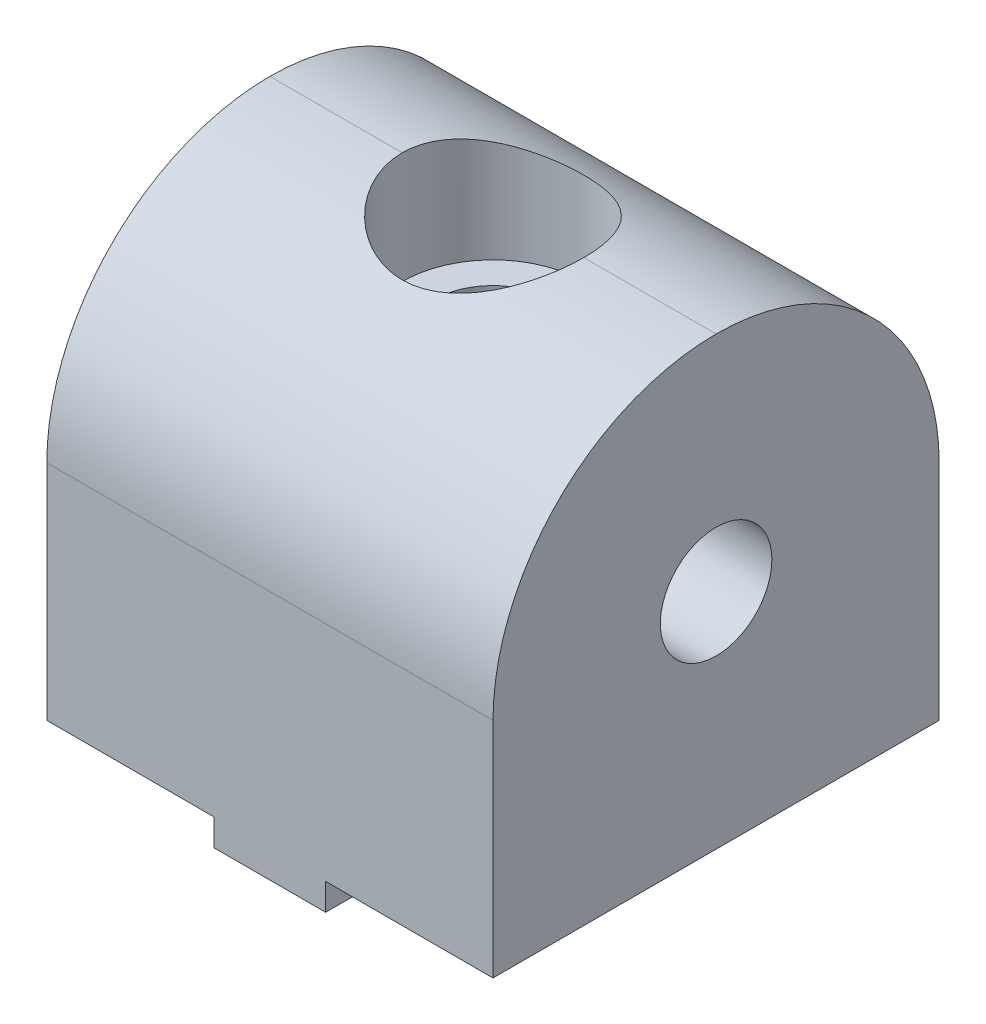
ISO-10303-21;
HEADER;
FILE_DESCRIPTION(('STEP AP214'),'2;1');
FILE_NAME('part.step','',(''),(''),'','','');
FILE_SCHEMA(('AUTOMOTIVE_DESIGN { 1 0 10303 214 1 1 1 1 }'));
ENDSEC;
DATA;
#1=APPLICATION_CONTEXT('core data for automotive mechanical design processes');
#2=APPLICATION_PROTOCOL_DEFINITION('international standard','automotive_design',2000,#1);
#3=PRODUCT_CONTEXT('',#1,'mechanical');
#4=PRODUCT('Part','Part','',(#3));
#5=PRODUCT_RELATED_PRODUCT_CATEGORY('part','',(#4));
#6=PRODUCT_DEFINITION_FORMATION('','',#4);
#7=PRODUCT_DEFINITION_CONTEXT('part definition',#1,'design');
#8=PRODUCT_DEFINITION('design','',#6,#7);
#9=PRODUCT_DEFINITION_SHAPE('','',#8);
#10=(LENGTH_UNIT() NAMED_UNIT(*) SI_UNIT(.MILLI.,.METRE.));
#11=(NAMED_UNIT(*) PLANE_ANGLE_UNIT() SI_UNIT($,.RADIAN.));
#12=(NAMED_UNIT(*) SI_UNIT($,.STERADIAN.) SOLID_ANGLE_UNIT());
#13=UNCERTAINTY_MEASURE_WITH_UNIT(LENGTH_MEASURE(1.E-05),#10,'distance_accuracy_value','');
#14=(GEOMETRIC_REPRESENTATION_CONTEXT(3) GLOBAL_UNCERTAINTY_ASSIGNED_CONTEXT((#13)) GLOBAL_UNIT_ASSIGNED_CONTEXT((#10,
#11,#12)) REPRESENTATION_CONTEXT('',''));
#15=CARTESIAN_POINT('',(0.,0.,0.));
#16=DIRECTION('',(0.,0.,1.));
#17=DIRECTION('',(1.,0.,0.));
#18=AXIS2_PLACEMENT_3D('',#15,#16,#17);
#19=CARTESIAN_POINT('',(0.,0.,0.));
#20=DIRECTION('',(0.,-1.,0.));
#21=DIRECTION('',(0.,0.,-1.));
#22=AXIS2_PLACEMENT_3D('',#19,#20,#21);
#23=PLANE('',#22);
#24=CARTESIAN_POINT('',(0.,0.,0.));
#25=DIRECTION('',(0.,1.,0.));
#26=DIRECTION('',(0.,0.,1.));
#27=AXIS2_PLACEMENT_3D('',#24,#25,#26);
#28=CIRCLE('',#27,3.3782);
#29=CARTESIAN_POINT('',(0.,0.,3.3782));
#30=VERTEX_POINT('',#29);
#31=EDGE_CURVE('E301',#30,#30,#28,.T.);
#32=ORIENTED_EDGE('',*,*,#31,.T.);
#33=EDGE_LOOP('',(#32));
#34=FACE_BOUND('',#33,.T.);
#35=DIRECTION('',(-1.,0.,0.));
#36=VECTOR('',#35,1.);
#37=CARTESIAN_POINT('',(-3.175,0.,-6.35));
#38=LINE('',#37,#36);
#39=CARTESIAN_POINT('',(3.175,0.,-6.35));
#40=VERTEX_POINT('',#39);
#41=CARTESIAN_POINT('',(-3.175,0.,-6.35));
#42=VERTEX_POINT('',#41);
#43=EDGE_CURVE('E336',#40,#42,#38,.T.);
#44=ORIENTED_EDGE('',*,*,#43,.F.);
#45=DIRECTION('',(0.,0.,1.));
#46=VECTOR('',#45,1.);
#47=CARTESIAN_POINT('',(3.175,0.,-12.7));
#48=LINE('',#47,#46);
#49=CARTESIAN_POINT('',(3.175,0.,-12.7));
#50=VERTEX_POINT('',#49);
#51=EDGE_CURVE('E335',#50,#40,#48,.T.);
#52=ORIENTED_EDGE('',*,*,#51,.F.);
#53=DIRECTION('',(-1.,0.,0.));
#54=VECTOR('',#53,1.);
#55=CARTESIAN_POINT('',(-12.7,0.,-12.7));
#56=LINE('',#55,#54);
#57=CARTESIAN_POINT('',(12.7,0.,-12.7));
#58=VERTEX_POINT('',#57);
#59=EDGE_CURVE('E172',#58,#50,#56,.T.);
#60=ORIENTED_EDGE('',*,*,#59,.F.);
#61=DIRECTION('',(0.,0.,-1.));
#62=VECTOR('',#61,1.);
#63=CARTESIAN_POINT('',(12.7,0.,12.7));
#64=LINE('',#63,#62);
#65=CARTESIAN_POINT('',(12.7,0.,12.7));
#66=VERTEX_POINT('',#65);
#67=EDGE_CURVE('E251',#66,#58,#64,.T.);
#68=ORIENTED_EDGE('',*,*,#67,.F.);
#69=DIRECTION('',(1.,0.,0.));
#70=VECTOR('',#69,1.);
#71=CARTESIAN_POINT('',(-12.7,0.,12.7));
#72=LINE('',#71,#70);
#73=CARTESIAN_POINT('',(3.175,0.,12.7));
#74=VERTEX_POINT('',#73);
#75=EDGE_CURVE('E215',#74,#66,#72,.T.);
#76=ORIENTED_EDGE('',*,*,#75,.F.);
#77=DIRECTION('',(0.,0.,1.));
#78=VECTOR('',#77,1.);
#79=CARTESIAN_POINT('',(3.175,0.,12.7));
#80=LINE('',#79,#78);
#81=CARTESIAN_POINT('',(3.175,0.,6.35));
#82=VERTEX_POINT('',#81);
#83=EDGE_CURVE('E184',#82,#74,#80,.T.);
#84=ORIENTED_EDGE('',*,*,#83,.F.);
#85=DIRECTION('',(1.,0.,0.));
#86=VECTOR('',#85,1.);
#87=CARTESIAN_POINT('',(-3.175,0.,6.35));
#88=LINE('',#87,#86);
#89=CARTESIAN_POINT('',(-3.175,0.,6.35));
#90=VERTEX_POINT('',#89);
#91=EDGE_CURVE('E70',#90,#82,#88,.T.);
#92=ORIENTED_EDGE('',*,*,#91,.F.);
#93=DIRECTION('',(0.,0.,-1.));
#94=VECTOR('',#93,1.);
#95=CARTESIAN_POINT('',(-3.175,0.,12.7));
#96=LINE('',#95,#94);
#97=CARTESIAN_POINT('',(-3.175,0.,12.7));
#98=VERTEX_POINT('',#97);
#99=EDGE_CURVE('E173',#98,#90,#96,.T.);
#100=ORIENTED_EDGE('',*,*,#99,.F.);
#101=CARTESIAN_POINT('',(-12.7,0.,12.7));
#102=VERTEX_POINT('',#101);
#103=EDGE_CURVE('E218',#102,#98,#72,.T.);
#104=ORIENTED_EDGE('',*,*,#103,.F.);
#105=DIRECTION('',(0.,0.,1.));
#106=VECTOR('',#105,1.);
#107=CARTESIAN_POINT('',(-12.7,0.,12.7));
#108=LINE('',#107,#106);
#109=CARTESIAN_POINT('',(-12.7,0.,-12.7));
#110=VERTEX_POINT('',#109);
#111=EDGE_CURVE('E219',#110,#102,#108,.T.);
#112=ORIENTED_EDGE('',*,*,#111,.F.);
#113=CARTESIAN_POINT('',(-3.175,0.,-12.7));
#114=VERTEX_POINT('',#113);
#115=EDGE_CURVE('E305',#114,#110,#56,.T.);
#116=ORIENTED_EDGE('',*,*,#115,.F.);
#117=DIRECTION('',(0.,0.,-1.));
#118=VECTOR('',#117,1.);
#119=CARTESIAN_POINT('',(-3.175,0.,-12.7));
#120=LINE('',#119,#118);
#121=EDGE_CURVE('E166',#42,#114,#120,.T.);
#122=ORIENTED_EDGE('',*,*,#121,.F.);
#123=EDGE_LOOP('',(#44,#52,#60,#68,#76,#84,#92,#100,#104,#112,#116,#122));
#124=FACE_BOUND('',#123,.T.);
#125=ADVANCED_FACE('F44',(#34,#124),#23,.T.);
#126=CARTESIAN_POINT('',(0.,0.,0.));
#127=DIRECTION('',(0.,1.,0.));
#128=DIRECTION('',(0.,0.,1.));
#129=AXIS2_PLACEMENT_3D('',#126,#127,#128);
#130=CYLINDRICAL_SURFACE('',#129,3.3782);
#131=ORIENTED_EDGE('',*,*,#31,.F.);
#132=EDGE_LOOP('',(#131));
#133=FACE_BOUND('',#132,.T.);
#134=CARTESIAN_POINT('',(1.15395417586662,12.7,-3.175));
#135=CARTESIAN_POINT('',(1.15399166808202,12.7821326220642,-3.17499180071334));
#136=CARTESIAN_POINT('',(1.16300427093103,12.8643329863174,-3.17175372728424));
#137=CARTESIAN_POINT('',(1.19626789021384,13.0252850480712,-3.15934216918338));
#138=CARTESIAN_POINT('',(1.22060490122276,13.104014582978,-3.15013518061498));
#139=CARTESIAN_POINT('',(1.27281416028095,13.239879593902,-3.12934320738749));
#140=CARTESIAN_POINT('',(1.298738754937,13.2979625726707,-3.11872338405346));
#141=CARTESIAN_POINT('',(1.3547833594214,13.4115177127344,-3.09479103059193));
#142=CARTESIAN_POINT('',(1.38490681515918,13.4669876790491,-3.08147628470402));
#143=CARTESIAN_POINT('',(1.47954924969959,13.6302879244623,-3.03775566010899));
#144=CARTESIAN_POINT('',(1.54820400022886,13.7347000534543,-3.00362374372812));
#145=CARTESIAN_POINT('',(1.68989432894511,13.9366079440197,-2.92627170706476));
#146=CARTESIAN_POINT('',(1.7629258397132,14.0341099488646,-2.8830599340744));
#147=CARTESIAN_POINT('',(1.91036207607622,14.2236169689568,-2.78755703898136));
#148=CARTESIAN_POINT('',(1.98476785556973,14.3156175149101,-2.73525866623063));
#149=CARTESIAN_POINT('',(2.13272769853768,14.4942693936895,-2.62152873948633));
#150=CARTESIAN_POINT('',(2.20628277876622,14.5809278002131,-2.56010964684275));
#151=CARTESIAN_POINT('',(2.35101526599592,14.7487699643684,-2.42787346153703));
#152=CARTESIAN_POINT('',(2.42219406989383,14.8299569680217,-2.35706201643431));
#153=CARTESIAN_POINT('',(2.5928540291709,15.0225205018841,-2.17068437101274));
#154=CARTESIAN_POINT('',(2.6902143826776,15.1305111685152,-2.04955784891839));
#155=CARTESIAN_POINT('',(2.87190327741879,15.3301915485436,-1.78603706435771));
#156=CARTESIAN_POINT('',(2.95625430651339,15.4219094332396,-1.64368035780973));
#157=CARTESIAN_POINT('',(3.09075667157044,15.5673610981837,-1.37026058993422));
#158=CARTESIAN_POINT('',(3.14437217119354,15.6250274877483,-1.24300788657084));
#159=CARTESIAN_POINT('',(3.2368415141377,15.7242117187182,-0.977139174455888));
#160=CARTESIAN_POINT('',(3.27570389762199,15.7657389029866,-0.838529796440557));
#161=CARTESIAN_POINT('',(3.32085060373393,15.8139152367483,-0.624190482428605));
#162=CARTESIAN_POINT('',(3.3337349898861,15.8276497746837,-0.551346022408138));
#163=CARTESIAN_POINT('',(3.35475054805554,15.8500407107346,-0.404217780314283));
#164=CARTESIAN_POINT('',(3.36288400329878,15.8586995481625,-0.329934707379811));
#165=CARTESIAN_POINT('',(3.3742010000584,15.8707454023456,-0.180581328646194));
#166=CARTESIAN_POINT('',(3.37738563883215,15.8741335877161,-0.105511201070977));
#167=CARTESIAN_POINT('',(3.37874069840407,15.8755752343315,0.0447010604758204));
#168=CARTESIAN_POINT('',(3.37691161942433,15.8736292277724,0.119843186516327));
#169=CARTESIAN_POINT('',(3.3649631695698,15.8609140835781,0.326551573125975));
#170=CARTESIAN_POINT('',(3.34959443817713,15.8445578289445,0.457543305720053));
#171=CARTESIAN_POINT('',(3.30446342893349,15.7964392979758,0.713974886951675));
#172=CARTESIAN_POINT('',(3.27469931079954,15.7646750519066,0.839414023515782));
#173=CARTESIAN_POINT('',(3.20159968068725,15.686441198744,1.08581489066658));
#174=CARTESIAN_POINT('',(3.15788740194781,15.6395629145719,1.20653304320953));
#175=CARTESIAN_POINT('',(3.0595783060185,15.5336891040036,1.43771754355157));
#176=CARTESIAN_POINT('',(3.00497585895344,15.474687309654,1.54817854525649));
#177=CARTESIAN_POINT('',(2.85654074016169,15.3133656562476,1.81269441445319));
#178=CARTESIAN_POINT('',(2.75706529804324,15.2044667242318,1.95958013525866));
#179=CARTESIAN_POINT('',(2.54513591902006,14.969095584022,2.22797327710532));
#180=CARTESIAN_POINT('',(2.43264934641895,14.8425790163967,2.34941463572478));
#181=CARTESIAN_POINT('',(2.25752892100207,14.6406094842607,2.51444905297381));
#182=CARTESIAN_POINT('',(2.19729789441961,14.5702977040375,2.56715023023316));
#183=CARTESIAN_POINT('',(2.07593621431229,14.4261017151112,2.666243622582));
#184=CARTESIAN_POINT('',(2.01480575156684,14.3522182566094,2.71263715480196));
#185=CARTESIAN_POINT('',(1.89272842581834,14.2009360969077,2.79917902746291));
#186=CARTESIAN_POINT('',(1.83178142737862,14.1235421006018,2.83933542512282));
#187=CARTESIAN_POINT('',(1.71134562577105,13.9648232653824,2.91350662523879));
#188=CARTESIAN_POINT('',(1.65185608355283,13.8835004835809,2.94752459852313));
#189=CARTESIAN_POINT('',(1.53786158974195,13.7182850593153,3.0085349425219));
#190=CARTESIAN_POINT('',(1.48326741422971,13.6345136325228,3.03568653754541));
#191=CARTESIAN_POINT('',(1.38061811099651,13.461186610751,3.08371708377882));
#192=CARTESIAN_POINT('',(1.33256040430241,13.371633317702,3.10459851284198));
#193=CARTESIAN_POINT('',(1.26095469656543,13.2117796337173,3.13421311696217));
#194=CARTESIAN_POINT('',(1.23432201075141,13.1432336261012,3.14471217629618));
#195=CARTESIAN_POINT('',(1.1911154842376,13.0026258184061,3.16133205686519));
#196=CARTESIAN_POINT('',(1.17450526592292,12.9305777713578,3.16746872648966));
#197=CARTESIAN_POINT('',(1.15463935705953,12.7832264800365,3.17477275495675));
#198=CARTESIAN_POINT('',(1.1515749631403,12.7078916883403,3.17586893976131));
#199=CARTESIAN_POINT('',(1.16021714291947,12.5581610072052,3.17271816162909));
#200=CARTESIAN_POINT('',(1.17194483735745,12.4837666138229,3.16846355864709));
#201=CARTESIAN_POINT('',(1.21108067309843,12.3224009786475,3.1537303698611));
#202=CARTESIAN_POINT('',(1.24138185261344,12.2362846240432,3.14208389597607));
#203=CARTESIAN_POINT('',(1.31275408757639,12.0695627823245,3.11294052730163));
#204=CARTESIAN_POINT('',(1.35387465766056,11.9889848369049,3.09541663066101));
#205=CARTESIAN_POINT('',(1.44625805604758,11.8253493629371,3.05342220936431));
#206=CARTESIAN_POINT('',(1.49810898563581,11.742760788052,3.02845643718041));
#207=CARTESIAN_POINT('',(1.605599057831,11.5820132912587,2.97287153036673));
#208=CARTESIAN_POINT('',(1.6612422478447,11.5038592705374,2.94224629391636));
#209=CARTESIAN_POINT('',(1.77434000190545,11.3511879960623,2.87546077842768));
#210=CARTESIAN_POINT('',(1.83179644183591,11.2766747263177,2.83929460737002));
#211=CARTESIAN_POINT('',(1.94717917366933,11.1309657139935,2.76144501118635));
#212=CARTESIAN_POINT('',(2.00510551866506,11.0597703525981,2.7197609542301));
#213=CARTESIAN_POINT('',(2.12886596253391,10.9104612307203,2.62433214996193));
#214=CARTESIAN_POINT('',(2.1946290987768,10.8328406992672,2.56971500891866));
#215=CARTESIAN_POINT('',(2.32439456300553,10.6819136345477,2.45297014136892));
#216=CARTESIAN_POINT('',(2.38839638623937,10.6086083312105,2.39084028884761));
#217=CARTESIAN_POINT('',(2.57595046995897,10.3960013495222,2.19307998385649));
#218=CARTESIAN_POINT('',(2.69548959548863,10.2634924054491,2.04575442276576));
#219=CARTESIAN_POINT('',(2.88264737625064,10.0581789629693,1.76692928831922));
#220=CARTESIAN_POINT('',(2.95525741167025,9.97921631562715,1.6432793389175));
#221=CARTESIAN_POINT('',(3.08672817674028,9.83695445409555,1.38051815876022));
#222=CARTESIAN_POINT('',(3.14560508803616,9.77363680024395,1.24142541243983));
#223=CARTESIAN_POINT('',(3.23802468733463,9.67453167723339,0.971886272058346));
#224=CARTESIAN_POINT('',(3.27404840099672,9.63603307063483,0.843296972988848));
#225=CARTESIAN_POINT('',(3.33093438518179,9.57531952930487,0.579075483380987));
#226=CARTESIAN_POINT('',(3.35180572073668,9.55309485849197,0.443447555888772));
#227=CARTESIAN_POINT('',(3.37683468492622,9.52644940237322,0.168385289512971));
#228=CARTESIAN_POINT('',(3.38093091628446,9.52209401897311,0.0289388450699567));
#229=CARTESIAN_POINT('',(3.37189247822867,9.53171162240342,-0.24875049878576));
#230=CARTESIAN_POINT('',(3.35875708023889,9.545685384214,-0.386993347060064));
#231=CARTESIAN_POINT('',(3.31757385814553,9.58957566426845,-0.650120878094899));
#232=CARTESIAN_POINT('',(3.29043355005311,9.61852219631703,-0.775315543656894));
#233=CARTESIAN_POINT('',(3.22357730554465,9.69001685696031,-1.01817366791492));
#234=CARTESIAN_POINT('',(3.18385712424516,9.73256957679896,-1.135834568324));
#235=CARTESIAN_POINT('',(3.07745024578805,9.84698562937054,-1.40324556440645));
#236=CARTESIAN_POINT('',(3.00621234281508,9.92387837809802,-1.54903679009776));
#237=CARTESIAN_POINT('',(2.84929490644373,10.0946233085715,-1.82171629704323));
#238=CARTESIAN_POINT('',(2.7635840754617,10.1885122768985,-1.94856246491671));
#239=CARTESIAN_POINT('',(2.55083934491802,10.4243229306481,-2.22377828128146));
#240=CARTESIAN_POINT('',(2.41976240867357,10.5716297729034,-2.36443244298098));
#241=CARTESIAN_POINT('',(2.21711853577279,10.8064488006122,-2.55050425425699));
#242=CARTESIAN_POINT('',(2.14850812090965,10.8871021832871,-2.60841320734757));
#243=CARTESIAN_POINT('',(2.01052361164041,11.0529694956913,-2.71618969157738));
#244=CARTESIAN_POINT('',(1.94114983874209,11.1381815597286,-2.76606047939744));
#245=CARTESIAN_POINT('',(1.78815285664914,11.332410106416,-2.8679031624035));
#246=CARTESIAN_POINT('',(1.70470615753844,11.4425780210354,-2.9179802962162));
#247=CARTESIAN_POINT('',(1.58393726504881,11.6142467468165,-2.98420899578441));
#248=CARTESIAN_POINT('',(1.54442691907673,11.672518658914,-3.00479868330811));
#249=CARTESIAN_POINT('',(1.46788187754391,11.7916189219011,-3.04292292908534));
#250=CARTESIAN_POINT('',(1.43084605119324,11.8524460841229,-3.06045888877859));
#251=CARTESIAN_POINT('',(1.35486985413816,11.987473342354,-3.09492618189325));
#252=CARTESIAN_POINT('',(1.31662506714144,12.0622229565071,-3.1112793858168));
#253=CARTESIAN_POINT('',(1.24920462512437,12.2165985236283,-3.13895732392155));
#254=CARTESIAN_POINT('',(1.22000383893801,12.2962102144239,-3.15029603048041));
#255=CARTESIAN_POINT('',(1.18395584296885,12.4304327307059,-3.16397199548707));
#256=CARTESIAN_POINT('',(1.17284435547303,12.4836909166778,-3.16808117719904));
#257=CARTESIAN_POINT('',(1.15783747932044,12.5912908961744,-3.17359550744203));
#258=CARTESIAN_POINT('',(1.15392935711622,12.6456306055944,-3.17500542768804));
#259=CARTESIAN_POINT('',(1.15395417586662,12.7,-3.175));
#260=B_SPLINE_CURVE_WITH_KNOTS('',3,(#134,#135,#136,#137,#138,#139,#140,#141,#142,#143,#144,
#145,#146,#147,#148,#149,#150,#151,#152,#153,#154,#155,#156,#157,#158,#159,#160,#161,#162,#163,
#164,#165,#166,#167,#168,#169,#170,#171,#172,#173,#174,#175,#176,#177,#178,#179,#180,#181,#182,
#183,#184,#185,#186,#187,#188,#189,#190,#191,#192,#193,#194,#195,#196,#197,#198,#199,#200,#201,
#202,#203,#204,#205,#206,#207,#208,#209,#210,#211,#212,#213,#214,#215,#216,#217,#218,#219,#220,
#221,#222,#223,#224,#225,#226,#227,#228,#229,#230,#231,#232,#233,#234,#235,#236,#237,#238,#239,
#240,#241,#242,#243,#244,#245,#246,#247,#248,#249,#250,#251,#252,#253,#254,#255,#256,#257,#258,
#259),.UNSPECIFIED.,.T.,.F.,(4,2,2,2,2,2,2,2,2,2,2,2,2,2,2,2,2,2,2,2,2,2,2,2,2,2,2,2,2,2,2,2,2,
2,2,2,2,2,2,2,2,2,2,2,2,2,2,2,2,2,2,2,2,2,2,2,2,2,2,2,2,2,4),(0.,0.246102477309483,
0.493598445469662,0.686784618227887,0.880130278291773,1.26783478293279,1.65518441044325,
2.04284455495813,2.42997984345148,2.81688339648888,3.38257562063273,3.94727875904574,
4.39451756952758,4.84149708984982,5.06693328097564,5.29226104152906,5.51753883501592,
5.74279415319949,6.13945675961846,6.53617008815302,6.94466415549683,7.35336995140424,
7.97442664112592,8.59707635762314,8.91646674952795,9.23579034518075,9.55469794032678,
9.87344032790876,10.183922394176,10.4942816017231,10.7165066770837,10.9379202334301,
11.1624508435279,11.3873024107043,11.6618558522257,11.9376883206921,12.2392312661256,
12.541101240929,12.8432944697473,13.14552233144,13.4915625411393,13.8377009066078,
14.5277481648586,15.0171959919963,15.5060641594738,15.92124174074,16.3361707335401,
16.7526170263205,17.1690809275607,17.5614302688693,17.9539121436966,18.4896211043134,
19.026503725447,19.7489620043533,20.110774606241,20.4724402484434,20.9126305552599,
21.1325792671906,21.3524267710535,21.6085817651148,21.8640184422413,22.0272198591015,
22.1901325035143),.UNSPECIFIED.);
#261=CARTESIAN_POINT('',(1.15395417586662,12.7,-3.175));
#262=VERTEX_POINT('',#261);
#263=EDGE_CURVE('E253',#262,#262,#260,.T.);
#264=ORIENTED_EDGE('',*,*,#263,.T.);
#265=EDGE_LOOP('',(#264));
#266=FACE_BOUND('',#265,.T.);
#267=CARTESIAN_POINT('',(-1.15395417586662,12.7,-3.175));
#268=CARTESIAN_POINT('',(-1.15399166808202,12.6178673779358,-3.17499180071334));
#269=CARTESIAN_POINT('',(-1.16300427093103,12.5356670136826,-3.17175372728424));
#270=CARTESIAN_POINT('',(-1.19626789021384,12.3747149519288,-3.15934216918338));
#271=CARTESIAN_POINT('',(-1.22060490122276,12.295985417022,-3.15013518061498));
#272=CARTESIAN_POINT('',(-1.27281416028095,12.160120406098,-3.12934320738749));
#273=CARTESIAN_POINT('',(-1.29873875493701,12.1020374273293,-3.11872338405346));
#274=CARTESIAN_POINT('',(-1.3547833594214,11.9884822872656,-3.09479103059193));
#275=CARTESIAN_POINT('',(-1.38490681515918,11.9330123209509,-3.08147628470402));
#276=CARTESIAN_POINT('',(-1.47954924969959,11.7697120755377,-3.03775566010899));
#277=CARTESIAN_POINT('',(-1.54820400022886,11.6652999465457,-3.00362374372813));
#278=CARTESIAN_POINT('',(-1.68989432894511,11.4633920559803,-2.92627170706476));
#279=CARTESIAN_POINT('',(-1.7629258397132,11.3658900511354,-2.8830599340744));
#280=CARTESIAN_POINT('',(-1.91036207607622,11.1763830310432,-2.78755703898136));
#281=CARTESIAN_POINT('',(-1.98476785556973,11.0843824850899,-2.73525866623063));
#282=CARTESIAN_POINT('',(-2.13272769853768,10.9057306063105,-2.62152873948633));
#283=CARTESIAN_POINT('',(-2.20628277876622,10.8190721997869,-2.56010964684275));
#284=CARTESIAN_POINT('',(-2.35101526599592,10.6512300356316,-2.42787346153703));
#285=CARTESIAN_POINT('',(-2.42219406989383,10.5700430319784,-2.35706201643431));
#286=CARTESIAN_POINT('',(-2.5928540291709,10.3774794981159,-2.17068437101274));
#287=CARTESIAN_POINT('',(-2.6902143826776,10.2694888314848,-2.04955784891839));
#288=CARTESIAN_POINT('',(-2.87190327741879,10.0698084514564,-1.78603706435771));
#289=CARTESIAN_POINT('',(-2.95625430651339,9.97809056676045,-1.64368035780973));
#290=CARTESIAN_POINT('',(-3.09075667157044,9.83263890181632,-1.37026058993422));
#291=CARTESIAN_POINT('',(-3.14437217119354,9.77497251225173,-1.24300788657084));
#292=CARTESIAN_POINT('',(-3.2368415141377,9.67578828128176,-0.977139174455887));
#293=CARTESIAN_POINT('',(-3.27570389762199,9.63426109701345,-0.838529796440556));
#294=CARTESIAN_POINT('',(-3.32085060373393,9.58608476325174,-0.624190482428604));
#295=CARTESIAN_POINT('',(-3.3337349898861,9.57235022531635,-0.551346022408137));
#296=CARTESIAN_POINT('',(-3.35475054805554,9.54995928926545,-0.404217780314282));
#297=CARTESIAN_POINT('',(-3.36288400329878,9.54130045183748,-0.32993470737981));
#298=CARTESIAN_POINT('',(-3.3742010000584,9.52925459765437,-0.180581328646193));
#299=CARTESIAN_POINT('',(-3.37738563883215,9.52586641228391,-0.105511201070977));
#300=CARTESIAN_POINT('',(-3.37874069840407,9.52442476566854,0.0447010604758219));
#301=CARTESIAN_POINT('',(-3.37691161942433,9.52637077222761,0.119843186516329));
#302=CARTESIAN_POINT('',(-3.3649631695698,9.53908591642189,0.326551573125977));
#303=CARTESIAN_POINT('',(-3.34959443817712,9.55544217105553,0.457543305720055));
#304=CARTESIAN_POINT('',(-3.30446342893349,9.60356070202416,0.713974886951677));
#305=CARTESIAN_POINT('',(-3.27469931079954,9.6353249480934,0.839414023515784));
#306=CARTESIAN_POINT('',(-3.20159968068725,9.713558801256,1.08581489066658));
#307=CARTESIAN_POINT('',(-3.15788740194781,9.76043708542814,1.20653304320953));
#308=CARTESIAN_POINT('',(-3.0595783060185,9.86631089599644,1.43771754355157));
#309=CARTESIAN_POINT('',(-3.00497585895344,9.92531269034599,1.54817854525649));
#310=CARTESIAN_POINT('',(-2.85654074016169,10.0866343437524,1.81269441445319));
#311=CARTESIAN_POINT('',(-2.75706529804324,10.1955332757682,1.95958013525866));
#312=CARTESIAN_POINT('',(-2.54513591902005,10.430904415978,2.22797327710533));
#313=CARTESIAN_POINT('',(-2.43264934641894,10.5574209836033,2.34941463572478));
#314=CARTESIAN_POINT('',(-2.25752892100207,10.7593905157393,2.51444905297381));
#315=CARTESIAN_POINT('',(-2.1972978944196,10.8297022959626,2.56715023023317));
#316=CARTESIAN_POINT('',(-2.07593621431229,10.9738982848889,2.66624362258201));
#317=CARTESIAN_POINT('',(-2.01480575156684,11.0477817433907,2.71263715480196));
#318=CARTESIAN_POINT('',(-1.89272842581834,11.1990639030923,2.79917902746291));
#319=CARTESIAN_POINT('',(-1.83178142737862,11.2764578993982,2.83933542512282));
#320=CARTESIAN_POINT('',(-1.71134562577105,11.4351767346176,2.9135066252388));
#321=CARTESIAN_POINT('',(-1.65185608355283,11.5164995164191,2.94752459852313));
#322=CARTESIAN_POINT('',(-1.53786158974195,11.6817149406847,3.0085349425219));
#323=CARTESIAN_POINT('',(-1.4832674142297,11.7654863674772,3.03568653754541));
#324=CARTESIAN_POINT('',(-1.38061811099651,11.938813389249,3.08371708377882));
#325=CARTESIAN_POINT('',(-1.33256040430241,12.028366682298,3.10459851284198));
#326=CARTESIAN_POINT('',(-1.26095469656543,12.1882203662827,3.13421311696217));
#327=CARTESIAN_POINT('',(-1.23432201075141,12.2567663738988,3.14471217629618));
#328=CARTESIAN_POINT('',(-1.1911154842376,12.3973741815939,3.16133205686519));
#329=CARTESIAN_POINT('',(-1.17450526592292,12.4694222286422,3.16746872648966));
#330=CARTESIAN_POINT('',(-1.15463935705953,12.6167735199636,3.17477275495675));
#331=CARTESIAN_POINT('',(-1.1515749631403,12.6921083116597,3.17586893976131));
#332=CARTESIAN_POINT('',(-1.16021714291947,12.8418389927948,3.17271816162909));
#333=CARTESIAN_POINT('',(-1.17194483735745,12.9162333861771,3.16846355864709));
#334=CARTESIAN_POINT('',(-1.21108067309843,13.0775990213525,3.1537303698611));
#335=CARTESIAN_POINT('',(-1.24138185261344,13.1637153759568,3.14208389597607));
#336=CARTESIAN_POINT('',(-1.31275408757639,13.3304372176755,3.11294052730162));
#337=CARTESIAN_POINT('',(-1.35387465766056,13.4110151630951,3.09541663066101));
#338=CARTESIAN_POINT('',(-1.44625805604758,13.5746506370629,3.05342220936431));
#339=CARTESIAN_POINT('',(-1.49810898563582,13.6572392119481,3.02845643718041));
#340=CARTESIAN_POINT('',(-1.60559905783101,13.8179867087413,2.97287153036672));
#341=CARTESIAN_POINT('',(-1.66124224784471,13.8961407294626,2.94224629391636));
#342=CARTESIAN_POINT('',(-1.77434000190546,14.0488120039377,2.87546077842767));
#343=CARTESIAN_POINT('',(-1.83179644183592,14.1233252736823,2.83929460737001));
#344=CARTESIAN_POINT('',(-1.94717917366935,14.2690342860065,2.76144501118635));
#345=CARTESIAN_POINT('',(-2.00510551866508,14.3402296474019,2.71976095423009));
#346=CARTESIAN_POINT('',(-2.12886596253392,14.4895387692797,2.62433214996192));
#347=CARTESIAN_POINT('',(-2.19462909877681,14.5671593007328,2.56971500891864));
#348=CARTESIAN_POINT('',(-2.32439456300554,14.7180863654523,2.45297014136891));
#349=CARTESIAN_POINT('',(-2.38839638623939,14.7913916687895,2.39084028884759));
#350=CARTESIAN_POINT('',(-2.57595046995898,15.0039986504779,2.19307998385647));
#351=CARTESIAN_POINT('',(-2.69548959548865,15.1365075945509,2.04575442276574));
#352=CARTESIAN_POINT('',(-2.88264737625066,15.3418210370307,1.7669292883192));
#353=CARTESIAN_POINT('',(-2.95525741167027,15.4207836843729,1.64327933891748));
#354=CARTESIAN_POINT('',(-3.08672817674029,15.5630455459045,1.38051815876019));
#355=CARTESIAN_POINT('',(-3.14560508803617,15.6263631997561,1.2414254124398));
#356=CARTESIAN_POINT('',(-3.23802468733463,15.7254683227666,0.97188627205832));
#357=CARTESIAN_POINT('',(-3.27404840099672,15.7639669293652,0.843296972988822));
#358=CARTESIAN_POINT('',(-3.3309343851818,15.8246804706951,0.579075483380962));
#359=CARTESIAN_POINT('',(-3.35180572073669,15.846905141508,0.443447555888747));
#360=CARTESIAN_POINT('',(-3.37683468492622,15.8735505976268,0.168385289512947));
#361=CARTESIAN_POINT('',(-3.38093091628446,15.8779059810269,0.0289388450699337));
#362=CARTESIAN_POINT('',(-3.37189247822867,15.8682883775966,-0.248750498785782));
#363=CARTESIAN_POINT('',(-3.35875708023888,15.854314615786,-0.386993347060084));
#364=CARTESIAN_POINT('',(-3.31757385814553,15.8104243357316,-0.650120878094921));
#365=CARTESIAN_POINT('',(-3.29043355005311,15.781477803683,-0.775315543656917));
#366=CARTESIAN_POINT('',(-3.22357730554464,15.7099831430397,-1.01817366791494));
#367=CARTESIAN_POINT('',(-3.18385712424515,15.667430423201,-1.13583456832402));
#368=CARTESIAN_POINT('',(-3.07745024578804,15.5530143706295,-1.40324556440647));
#369=CARTESIAN_POINT('',(-3.00621234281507,15.476121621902,-1.54903679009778));
#370=CARTESIAN_POINT('',(-2.84929490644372,15.3053766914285,-1.82171629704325));
#371=CARTESIAN_POINT('',(-2.76358407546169,15.2114877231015,-1.94856246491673));
#372=CARTESIAN_POINT('',(-2.550839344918,14.9756770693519,-2.22377828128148));
#373=CARTESIAN_POINT('',(-2.41976240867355,14.8283702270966,-2.364432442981));
#374=CARTESIAN_POINT('',(-2.21711853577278,14.5935511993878,-2.55050425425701));
#375=CARTESIAN_POINT('',(-2.14850812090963,14.5128978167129,-2.60841320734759));
#376=CARTESIAN_POINT('',(-2.01052361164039,14.3470305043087,-2.71618969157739));
#377=CARTESIAN_POINT('',(-1.94114983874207,14.2618184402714,-2.76606047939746));
#378=CARTESIAN_POINT('',(-1.78815285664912,14.067589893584,-2.86790316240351));
#379=CARTESIAN_POINT('',(-1.70470615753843,13.9574219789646,-2.91798029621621));
#380=CARTESIAN_POINT('',(-1.5839372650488,13.7857532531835,-2.98420899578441));
#381=CARTESIAN_POINT('',(-1.54442691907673,13.727481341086,-3.00479868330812));
#382=CARTESIAN_POINT('',(-1.46788187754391,13.6083810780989,-3.04292292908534));
#383=CARTESIAN_POINT('',(-1.43084605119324,13.5475539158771,-3.06045888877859));
#384=CARTESIAN_POINT('',(-1.35486985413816,13.412526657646,-3.09492618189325));
#385=CARTESIAN_POINT('',(-1.31662506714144,13.3377770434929,-3.1112793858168));
#386=CARTESIAN_POINT('',(-1.24920462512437,13.1834014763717,-3.13895732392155));
#387=CARTESIAN_POINT('',(-1.22000383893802,13.1037897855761,-3.15029603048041));
#388=CARTESIAN_POINT('',(-1.18395584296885,12.9695672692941,-3.16397199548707));
#389=CARTESIAN_POINT('',(-1.17284435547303,12.9163090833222,-3.16808117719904));
#390=CARTESIAN_POINT('',(-1.15783747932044,12.8087091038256,-3.17359550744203));
#391=CARTESIAN_POINT('',(-1.15392935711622,12.7543693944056,-3.17500542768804));
#392=CARTESIAN_POINT('',(-1.15395417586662,12.7,-3.175));
#393=B_SPLINE_CURVE_WITH_KNOTS('',3,(#267,#268,#269,#270,#271,#272,#273,#274,#275,#276,#277,
#278,#279,#280,#281,#282,#283,#284,#285,#286,#287,#288,#289,#290,#291,#292,#293,#294,#295,#296,
#297,#298,#299,#300,#301,#302,#303,#304,#305,#306,#307,#308,#309,#310,#311,#312,#313,#314,#315,
#316,#317,#318,#319,#320,#321,#322,#323,#324,#325,#326,#327,#328,#329,#330,#331,#332,#333,#334,
#335,#336,#337,#338,#339,#340,#341,#342,#343,#344,#345,#346,#347,#348,#349,#350,#351,#352,#353,
#354,#355,#356,#357,#358,#359,#360,#361,#362,#363,#364,#365,#366,#367,#368,#369,#370,#371,#372,
#373,#374,#375,#376,#377,#378,#379,#380,#381,#382,#383,#384,#385,#386,#387,#388,#389,#390,#391,
#392),.UNSPECIFIED.,.T.,.F.,(4,2,2,2,2,2,2,2,2,2,2,2,2,2,2,2,2,2,2,2,2,2,2,2,2,2,2,2,2,2,2,2,2,
2,2,2,2,2,2,2,2,2,2,2,2,2,2,2,2,2,2,2,2,2,2,2,2,2,2,2,2,2,4),(0.,0.246102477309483,
0.493598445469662,0.686784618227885,0.880130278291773,1.26783478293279,1.65518441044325,
2.04284455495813,2.42997984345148,2.81688339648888,3.38257562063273,3.94727875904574,
4.39451756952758,4.84149708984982,5.06693328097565,5.29226104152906,5.51753883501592,
5.74279415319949,6.13945675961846,6.53617008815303,6.94466415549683,7.35336995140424,
7.97442664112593,8.59707635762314,8.91646674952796,9.23579034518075,9.55469794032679,
9.87344032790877,10.183922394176,10.4942816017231,10.7165066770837,10.9379202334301,
11.1624508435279,11.3873024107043,11.6618558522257,11.9376883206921,12.2392312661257,
12.541101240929,12.8432944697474,13.1455223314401,13.4915625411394,13.8377009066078,
14.5277481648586,15.0171959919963,15.5060641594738,15.92124174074,16.3361707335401,
16.7526170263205,17.1690809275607,17.5614302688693,17.9539121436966,18.4896211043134,
19.0265037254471,19.7489620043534,20.1107746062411,20.4724402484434,20.9126305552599,
21.1325792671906,21.3524267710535,21.6085817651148,21.8640184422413,22.0272198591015,
22.1901325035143),.UNSPECIFIED.);
#394=CARTESIAN_POINT('',(-1.15395417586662,12.7,-3.175));
#395=VERTEX_POINT('',#394);
#396=EDGE_CURVE('E260',#395,#395,#393,.T.);
#397=ORIENTED_EDGE('',*,*,#396,.T.);
#398=EDGE_LOOP('',(#397));
#399=FACE_BOUND('',#398,.T.);
#400=CARTESIAN_POINT('',(0.,19.05,0.));
#401=DIRECTION('',(0.,1.,0.));
#402=DIRECTION('',(0.,0.,1.));
#403=AXIS2_PLACEMENT_3D('',#400,#401,#402);
#404=CIRCLE('',#403,3.3782);
#405=CARTESIAN_POINT('',(0.,19.05,3.3782));
#406=VERTEX_POINT('',#405);
#407=EDGE_CURVE('E295',#406,#406,#404,.F.);
#408=ORIENTED_EDGE('',*,*,#407,.F.);
#409=EDGE_LOOP('',(#408));
#410=FACE_BOUND('',#409,.T.);
#411=ADVANCED_FACE('F265',(#133,#266,#399,#410),#130,.F.);
#412=CARTESIAN_POINT('',(12.7,25.4,12.7));
#413=DIRECTION('',(-1.,0.,0.));
#414=DIRECTION('',(0.,0.,1.));
#415=AXIS2_PLACEMENT_3D('',#412,#413,#414);
#416=PLANE('',#415);
#417=CARTESIAN_POINT('',(12.7,12.7,0.));
#418=DIRECTION('',(1.,0.,0.));
#419=DIRECTION('',(0.,0.,-1.));
#420=AXIS2_PLACEMENT_3D('',#417,#418,#419);
#421=CIRCLE('',#420,3.175);
#422=CARTESIAN_POINT('',(12.7,12.7,-3.175));
#423=VERTEX_POINT('',#422);
#424=EDGE_CURVE('E294',#423,#423,#421,.T.);
#425=ORIENTED_EDGE('',*,*,#424,.F.);
#426=EDGE_LOOP('',(#425));
#427=FACE_BOUND('',#426,.T.);
#428=DIRECTION('',(0.,-1.,0.));
#429=VECTOR('',#428,1.);
#430=CARTESIAN_POINT('',(12.7,25.4,-12.7));
#431=LINE('',#430,#429);
#432=CARTESIAN_POINT('',(12.7,12.7,-12.7));
#433=VERTEX_POINT('',#432);
#434=EDGE_CURVE('E233',#433,#58,#431,.T.);
#435=ORIENTED_EDGE('',*,*,#434,.F.);
#436=CARTESIAN_POINT('',(12.7,12.7,0.));
#437=DIRECTION('',(-1.,0.,0.));
#438=DIRECTION('',(0.,0.,1.));
#439=AXIS2_PLACEMENT_3D('',#436,#437,#438);
#440=CIRCLE('',#439,12.7);
#441=CARTESIAN_POINT('',(12.7,25.4,0.));
#442=VERTEX_POINT('',#441);
#443=EDGE_CURVE('E244',#433,#442,#440,.F.);
#444=ORIENTED_EDGE('',*,*,#443,.T.);
#445=CARTESIAN_POINT('',(12.7,12.7,0.));
#446=DIRECTION('',(-1.,0.,0.));
#447=DIRECTION('',(0.,0.,1.));
#448=AXIS2_PLACEMENT_3D('',#445,#446,#447);
#449=CIRCLE('',#448,12.7);
#450=CARTESIAN_POINT('',(12.7,12.7,12.7));
#451=VERTEX_POINT('',#450);
#452=EDGE_CURVE('E242',#442,#451,#449,.F.);
#453=ORIENTED_EDGE('',*,*,#452,.T.);
#454=DIRECTION('',(0.,-1.,0.));
#455=VECTOR('',#454,1.);
#456=CARTESIAN_POINT('',(12.7,25.4,12.7));
#457=LINE('',#456,#455);
#458=EDGE_CURVE('E224',#451,#66,#457,.T.);
#459=ORIENTED_EDGE('',*,*,#458,.T.);
#460=ORIENTED_EDGE('',*,*,#67,.T.);
#461=EDGE_LOOP('',(#435,#444,#453,#459,#460));
#462=FACE_BOUND('',#461,.T.);
#463=ADVANCED_FACE('F333',(#427,#462),#416,.F.);
#464=CARTESIAN_POINT('',(-12.7,25.4,-12.7));
#465=DIRECTION('',(0.,0.,1.));
#466=DIRECTION('',(1.,0.,0.));
#467=AXIS2_PLACEMENT_3D('',#464,#465,#466);
#468=PLANE('',#467);
#469=DIRECTION('',(0.,-1.,0.));
#470=VECTOR('',#469,1.);
#471=CARTESIAN_POINT('',(-12.7,25.4,-12.7));
#472=LINE('',#471,#470);
#473=CARTESIAN_POINT('',(-12.7,12.7,-12.7));
#474=VERTEX_POINT('',#473);
#475=EDGE_CURVE('E230',#474,#110,#472,.T.);
#476=ORIENTED_EDGE('',*,*,#475,.F.);
#477=DIRECTION('',(-1.,0.,0.));
#478=VECTOR('',#477,1.);
#479=CARTESIAN_POINT('',(-12.7,12.7,-12.7));
#480=LINE('',#479,#478);
#481=EDGE_CURVE('E239',#474,#433,#480,.F.);
#482=ORIENTED_EDGE('',*,*,#481,.T.);
#483=ORIENTED_EDGE('',*,*,#434,.T.);
#484=ORIENTED_EDGE('',*,*,#59,.T.);
#485=DIRECTION('',(0.,1.,0.));
#486=VECTOR('',#485,1.);
#487=CARTESIAN_POINT('',(3.175,-1.524,-12.7));
#488=LINE('',#487,#486);
#489=CARTESIAN_POINT('',(3.175,-1.524,-12.7));
#490=VERTEX_POINT('',#489);
#491=EDGE_CURVE('E151',#490,#50,#488,.T.);
#492=ORIENTED_EDGE('',*,*,#491,.F.);
#493=DIRECTION('',(1.,0.,0.));
#494=VECTOR('',#493,1.);
#495=CARTESIAN_POINT('',(-3.175,-1.524,-12.7));
#496=LINE('',#495,#494);
#497=CARTESIAN_POINT('',(-3.175,-1.524,-12.7));
#498=VERTEX_POINT('',#497);
#499=EDGE_CURVE('E158',#498,#490,#496,.T.);
#500=ORIENTED_EDGE('',*,*,#499,.F.);
#501=DIRECTION('',(0.,1.,0.));
#502=VECTOR('',#501,1.);
#503=CARTESIAN_POINT('',(-3.175,-1.524,-12.7));
#504=LINE('',#503,#502);
#505=EDGE_CURVE('E309',#498,#114,#504,.T.);
#506=ORIENTED_EDGE('',*,*,#505,.T.);
#507=ORIENTED_EDGE('',*,*,#115,.T.);
#508=EDGE_LOOP('',(#476,#482,#483,#484,#492,#500,#506,#507));
#509=FACE_BOUND('',#508,.T.);
#510=ADVANCED_FACE('F170',(#509),#468,.F.);
#511=CARTESIAN_POINT('',(-12.7,25.4,12.7));
#512=DIRECTION('',(1.,0.,0.));
#513=DIRECTION('',(0.,0.,-1.));
#514=AXIS2_PLACEMENT_3D('',#511,#512,#513);
#515=PLANE('',#514);
#516=CARTESIAN_POINT('',(-12.7,12.7,0.));
#517=DIRECTION('',(1.,0.,0.));
#518=DIRECTION('',(0.,0.,-1.));
#519=AXIS2_PLACEMENT_3D('',#516,#517,#518);
#520=CIRCLE('',#519,3.175);
#521=CARTESIAN_POINT('',(-12.7,12.7,-3.175));
#522=VERTEX_POINT('',#521);
#523=EDGE_CURVE('E261',#522,#522,#520,.T.);
#524=ORIENTED_EDGE('',*,*,#523,.T.);
#525=EDGE_LOOP('',(#524));
#526=FACE_BOUND('',#525,.T.);
#527=CARTESIAN_POINT('',(-12.7,12.7,0.));
#528=DIRECTION('',(1.,0.,0.));
#529=DIRECTION('',(0.,0.,-1.));
#530=AXIS2_PLACEMENT_3D('',#527,#528,#529);
#531=CIRCLE('',#530,12.7);
#532=CARTESIAN_POINT('',(-12.7,12.7,12.7));
#533=VERTEX_POINT('',#532);
#534=CARTESIAN_POINT('',(-12.7,25.4,0.));
#535=VERTEX_POINT('',#534);
#536=EDGE_CURVE('E235',#533,#535,#531,.F.);
#537=ORIENTED_EDGE('',*,*,#536,.T.);
#538=CARTESIAN_POINT('',(-12.7,12.7,0.));
#539=DIRECTION('',(1.,0.,0.));
#540=DIRECTION('',(0.,0.,-1.));
#541=AXIS2_PLACEMENT_3D('',#538,#539,#540);
#542=CIRCLE('',#541,12.7);
#543=EDGE_CURVE('E237',#535,#474,#542,.F.);
#544=ORIENTED_EDGE('',*,*,#543,.T.);
#545=ORIENTED_EDGE('',*,*,#475,.T.);
#546=ORIENTED_EDGE('',*,*,#111,.T.);
#547=DIRECTION('',(0.,-1.,0.));
#548=VECTOR('',#547,1.);
#549=CARTESIAN_POINT('',(-12.7,25.4,12.7));
#550=LINE('',#549,#548);
#551=EDGE_CURVE('E228',#533,#102,#550,.T.);
#552=ORIENTED_EDGE('',*,*,#551,.F.);
#553=EDGE_LOOP('',(#537,#544,#545,#546,#552));
#554=FACE_BOUND('',#553,.T.);
#555=ADVANCED_FACE('F313',(#526,#554),#515,.F.);
#556=CARTESIAN_POINT('',(-12.7,25.4,12.7));
#557=DIRECTION('',(0.,0.,-1.));
#558=DIRECTION('',(-1.,0.,0.));
#559=AXIS2_PLACEMENT_3D('',#556,#557,#558);
#560=PLANE('',#559);
#561=ORIENTED_EDGE('',*,*,#458,.F.);
#562=DIRECTION('',(1.,0.,0.));
#563=VECTOR('',#562,1.);
#564=CARTESIAN_POINT('',(-12.7,12.7,12.7));
#565=LINE('',#564,#563);
#566=EDGE_CURVE('E54',#451,#533,#565,.F.);
#567=ORIENTED_EDGE('',*,*,#566,.T.);
#568=ORIENTED_EDGE('',*,*,#551,.T.);
#569=ORIENTED_EDGE('',*,*,#103,.T.);
#570=DIRECTION('',(0.,1.,0.));
#571=VECTOR('',#570,1.);
#572=CARTESIAN_POINT('',(-3.175,-1.524,12.7));
#573=LINE('',#572,#571);
#574=CARTESIAN_POINT('',(-3.175,-1.524,12.7));
#575=VERTEX_POINT('',#574);
#576=EDGE_CURVE('E190',#575,#98,#573,.T.);
#577=ORIENTED_EDGE('',*,*,#576,.F.);
#578=DIRECTION('',(-1.,0.,0.));
#579=VECTOR('',#578,1.);
#580=CARTESIAN_POINT('',(-3.175,-1.524,12.7));
#581=LINE('',#580,#579);
#582=CARTESIAN_POINT('',(3.175,-1.524,12.7));
#583=VERTEX_POINT('',#582);
#584=EDGE_CURVE('E188',#583,#575,#581,.T.);
#585=ORIENTED_EDGE('',*,*,#584,.F.);
#586=DIRECTION('',(0.,1.,0.));
#587=VECTOR('',#586,1.);
#588=CARTESIAN_POINT('',(3.175,-1.524,12.7));
#589=LINE('',#588,#587);
#590=EDGE_CURVE('E201',#583,#74,#589,.T.);
#591=ORIENTED_EDGE('',*,*,#590,.T.);
#592=ORIENTED_EDGE('',*,*,#75,.T.);
#593=EDGE_LOOP('',(#561,#567,#568,#569,#577,#585,#591,#592));
#594=FACE_BOUND('',#593,.T.);
#595=ADVANCED_FACE('F320',(#594),#560,.F.);
#596=CARTESIAN_POINT('',(0.,12.7,0.));
#597=DIRECTION('',(1.,0.,0.));
#598=DIRECTION('',(0.,0.,-1.));
#599=AXIS2_PLACEMENT_3D('',#596,#597,#598);
#600=CYLINDRICAL_SURFACE('',#599,12.7);
#601=CARTESIAN_POINT('',(-5.1689,25.4,0.));
#602=CARTESIAN_POINT('',(-5.16892104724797,25.4000217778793,0.139310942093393));
#603=CARTESIAN_POINT('',(-5.16326892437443,25.3977085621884,0.278612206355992));
#604=CARTESIAN_POINT('',(-5.14077560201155,25.3885716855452,0.556118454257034));
#605=CARTESIAN_POINT('',(-5.12393779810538,25.3817493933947,0.694323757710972));
#606=CARTESIAN_POINT('',(-5.07930855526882,25.3637852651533,0.968166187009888));
#607=CARTESIAN_POINT('',(-5.05155571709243,25.3526586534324,1.10381061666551));
#608=CARTESIAN_POINT('',(-4.98538157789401,25.3263840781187,1.37207277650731));
#609=CARTESIAN_POINT('',(-4.9469598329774,25.3112359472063,1.50469038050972));
#610=CARTESIAN_POINT('',(-4.85984508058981,25.2773192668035,1.76588850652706));
#611=CARTESIAN_POINT('',(-4.81116213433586,25.2585542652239,1.89447284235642));
#612=CARTESIAN_POINT('',(-4.70392832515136,25.2178656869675,2.14695789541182));
#613=CARTESIAN_POINT('',(-4.64537377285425,25.1959409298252,2.27085684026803));
#614=CARTESIAN_POINT('',(-4.45552124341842,25.1261907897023,2.6344858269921));
#615=CARTESIAN_POINT('',(-4.31000893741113,25.0743792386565,2.86622375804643));
#616=CARTESIAN_POINT('',(-3.97816622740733,24.9626598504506,3.31248293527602));
#617=CARTESIAN_POINT('',(-3.79033086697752,24.9024972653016,3.52581047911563));
#618=CARTESIAN_POINT('',(-3.3821303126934,24.7819440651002,3.91904743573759));
#619=CARTESIAN_POINT('',(-3.16175238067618,24.7215533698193,4.09894369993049));
#620=CARTESIAN_POINT('',(-2.80523630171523,24.6343066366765,4.34400162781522));
#621=CARTESIAN_POINT('',(-2.67895046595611,24.605174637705,4.42300863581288));
#622=CARTESIAN_POINT('',(-2.41961036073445,24.549513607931,4.57003236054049));
#623=CARTESIAN_POINT('',(-2.28655891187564,24.5229835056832,4.63805360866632));
#624=CARTESIAN_POINT('',(-2.01452170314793,24.473397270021,4.76252160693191));
#625=CARTESIAN_POINT('',(-1.8755357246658,24.4503412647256,4.81896793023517));
#626=CARTESIAN_POINT('',(-1.59266522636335,24.4085229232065,4.91970194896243));
#627=CARTESIAN_POINT('',(-1.44878322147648,24.3897584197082,4.96399578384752));
#628=CARTESIAN_POINT('',(-1.16389646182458,24.3579597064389,5.038207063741));
#629=CARTESIAN_POINT('',(-1.0230648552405,24.3447012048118,5.06869313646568));
#630=CARTESIAN_POINT('',(-0.739032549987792,24.3231925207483,5.11782351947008));
#631=CARTESIAN_POINT('',(-0.59583296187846,24.3149400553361,5.13647322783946));
#632=CARTESIAN_POINT('',(-0.308197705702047,24.3037412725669,5.16172260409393));
#633=CARTESIAN_POINT('',(-0.163762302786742,24.3007938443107,5.16832479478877));
#634=CARTESIAN_POINT('',(0.12515909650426,24.3003134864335,5.16940312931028));
#635=CARTESIAN_POINT('',(0.26964509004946,24.3027802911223,5.16387986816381));
#636=CARTESIAN_POINT('',(0.546969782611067,24.3126594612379,5.14162151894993));
#637=CARTESIAN_POINT('',(0.679890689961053,24.3196987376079,5.12573187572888));
#638=CARTESIAN_POINT('',(0.943848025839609,24.3381261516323,5.08375299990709));
#639=CARTESIAN_POINT('',(1.0748838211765,24.3495157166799,5.05766041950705));
#640=CARTESIAN_POINT('',(1.3341276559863,24.3762903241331,4.99553671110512));
#641=CARTESIAN_POINT('',(1.46233640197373,24.3916743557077,4.9595080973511));
#642=CARTESIAN_POINT('',(1.71518678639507,24.425980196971,4.87784191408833));
#643=CARTESIAN_POINT('',(1.83982703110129,24.4449033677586,4.83220064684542));
#644=CARTESIAN_POINT('',(2.21228202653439,24.5070366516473,4.67933793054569));
#645=CARTESIAN_POINT('',(2.45345310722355,24.5550451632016,4.55742257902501));
#646=CARTESIAN_POINT('',(2.91269822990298,24.6585112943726,4.2785566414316));
#647=CARTESIAN_POINT('',(3.13076310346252,24.7139718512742,4.12159222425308));
#648=CARTESIAN_POINT('',(3.55616444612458,24.8315172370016,3.76228795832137));
#649=CARTESIAN_POINT('',(3.76123711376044,24.8937765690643,3.55731825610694));
#650=CARTESIAN_POINT('',(4.13491901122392,25.0141644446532,3.11507465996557));
#651=CARTESIAN_POINT('',(4.30351642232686,25.0722916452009,2.87779033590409));
#652=CARTESIAN_POINT('',(4.52688530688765,25.1523182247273,2.49940014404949));
#653=CARTESIAN_POINT('',(4.59702270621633,25.1780417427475,2.36794882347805));
#654=CARTESIAN_POINT('',(4.7258821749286,25.2260868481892,2.09899123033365));
#655=CARTESIAN_POINT('',(4.78460912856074,25.2484098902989,1.96148757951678));
#656=CARTESIAN_POINT('',(4.89002438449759,25.2889810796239,1.68152974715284));
#657=CARTESIAN_POINT('',(4.93672532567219,25.3072335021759,1.5390809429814));
#658=CARTESIAN_POINT('',(5.01766002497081,25.3391460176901,1.25024175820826));
#659=CARTESIAN_POINT('',(5.05189902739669,25.3528080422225,1.10385306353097));
#660=CARTESIAN_POINT('',(5.10931046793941,25.3758330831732,0.798781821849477));
#661=CARTESIAN_POINT('',(5.13163226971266,25.3848641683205,0.639912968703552));
#662=CARTESIAN_POINT('',(5.16143976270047,25.3969644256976,0.320699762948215));
#663=CARTESIAN_POINT('',(5.16893762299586,25.4000384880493,0.160356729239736));
#664=CARTESIAN_POINT('',(5.1689,25.4,0.));
#665=B_SPLINE_CURVE_WITH_KNOTS('',3,(#601,#602,#603,#604,#605,#606,#607,#608,#609,#610,#611,
#612,#613,#614,#615,#616,#617,#618,#619,#620,#621,#622,#623,#624,#625,#626,#627,#628,#629,#630,
#631,#632,#633,#634,#635,#636,#637,#638,#639,#640,#641,#642,#643,#644,#645,#646,#647,#648,#649,
#650,#651,#652,#653,#654,#655,#656,#657,#658,#659,#660,#661,#662,#663,#664),.UNSPECIFIED.,.F.,
.F.,(4,2,2,2,2,2,2,2,2,2,2,2,2,2,2,2,2,2,2,2,2,2,2,2,2,2,2,2,2,2,2,4),(0.,0.417783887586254,
0.835441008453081,1.25163418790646,1.66784468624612,2.08364896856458,2.49960899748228,
3.33129020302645,4.19928891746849,5.0676282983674,5.52251300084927,5.97720959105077,
6.43192294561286,6.88640615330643,7.31993725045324,7.75327048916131,8.1865129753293,
8.6197342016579,9.02141867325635,9.42323505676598,9.82494985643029,10.2268194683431,
11.0464392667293,11.866383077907,12.7521004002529,13.6381042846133,14.0912036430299,
14.5441086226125,14.9965356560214,15.4487720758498,15.9300140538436,16.4108608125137),.UNSPECIFIED.);
#666=CARTESIAN_POINT('',(-5.1689,25.4,0.));
#667=VERTEX_POINT('',#666);
#668=CARTESIAN_POINT('',(5.1689,25.4,0.));
#669=VERTEX_POINT('',#668);
#670=EDGE_CURVE('E288',#667,#669,#665,.T.);
#671=ORIENTED_EDGE('',*,*,#670,.F.);
#672=DIRECTION('',(1.,0.,0.));
#673=VECTOR('',#672,1.);
#674=CARTESIAN_POINT('',(0.,25.4,0.));
#675=LINE('',#674,#673);
#676=EDGE_CURVE('E248',#535,#667,#675,.T.);
#677=ORIENTED_EDGE('',*,*,#676,.F.);
#678=ORIENTED_EDGE('',*,*,#536,.F.);
#679=ORIENTED_EDGE('',*,*,#566,.F.);
#680=ORIENTED_EDGE('',*,*,#452,.F.);
#681=EDGE_CURVE('E252',#669,#442,#675,.T.);
#682=ORIENTED_EDGE('',*,*,#681,.F.);
#683=EDGE_LOOP('',(#671,#677,#678,#679,#680,#682));
#684=FACE_BOUND('',#683,.T.);
#685=ADVANCED_FACE('F46',(#684),#600,.T.);
#686=CARTESIAN_POINT('',(0.,12.7,0.));
#687=DIRECTION('',(-1.,0.,0.));
#688=DIRECTION('',(0.,0.,1.));
#689=AXIS2_PLACEMENT_3D('',#686,#687,#688);
#690=CYLINDRICAL_SURFACE('',#689,12.7);
#691=CARTESIAN_POINT('',(5.1689,25.4,0.));
#692=CARTESIAN_POINT('',(5.16892104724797,25.4000217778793,-0.139310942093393));
#693=CARTESIAN_POINT('',(5.16326892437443,25.3977085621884,-0.278612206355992));
#694=CARTESIAN_POINT('',(5.14077560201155,25.3885716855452,-0.556118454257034));
#695=CARTESIAN_POINT('',(5.12393779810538,25.3817493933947,-0.694323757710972));
#696=CARTESIAN_POINT('',(5.07930855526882,25.3637852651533,-0.968166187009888));
#697=CARTESIAN_POINT('',(5.05155571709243,25.3526586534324,-1.10381061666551));
#698=CARTESIAN_POINT('',(4.98538157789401,25.3263840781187,-1.37207277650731));
#699=CARTESIAN_POINT('',(4.9469598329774,25.3112359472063,-1.50469038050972));
#700=CARTESIAN_POINT('',(4.85984508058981,25.2773192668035,-1.76588850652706));
#701=CARTESIAN_POINT('',(4.81116213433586,25.2585542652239,-1.89447284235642));
#702=CARTESIAN_POINT('',(4.70392832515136,25.2178656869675,-2.14695789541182));
#703=CARTESIAN_POINT('',(4.64537377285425,25.1959409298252,-2.27085684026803));
#704=CARTESIAN_POINT('',(4.45552124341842,25.1261907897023,-2.6344858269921));
#705=CARTESIAN_POINT('',(4.31000893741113,25.0743792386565,-2.86622375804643));
#706=CARTESIAN_POINT('',(3.97816622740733,24.9626598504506,-3.31248293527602));
#707=CARTESIAN_POINT('',(3.79033086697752,24.9024972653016,-3.52581047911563));
#708=CARTESIAN_POINT('',(3.3821303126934,24.7819440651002,-3.91904743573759));
#709=CARTESIAN_POINT('',(3.16175238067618,24.7215533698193,-4.09894369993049));
#710=CARTESIAN_POINT('',(2.80523630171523,24.6343066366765,-4.34400162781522));
#711=CARTESIAN_POINT('',(2.67895046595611,24.605174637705,-4.42300863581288));
#712=CARTESIAN_POINT('',(2.41961036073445,24.549513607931,-4.57003236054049));
#713=CARTESIAN_POINT('',(2.28655891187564,24.5229835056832,-4.63805360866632));
#714=CARTESIAN_POINT('',(2.01452170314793,24.473397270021,-4.76252160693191));
#715=CARTESIAN_POINT('',(1.8755357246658,24.4503412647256,-4.81896793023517));
#716=CARTESIAN_POINT('',(1.59266522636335,24.4085229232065,-4.91970194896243));
#717=CARTESIAN_POINT('',(1.44878322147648,24.3897584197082,-4.96399578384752));
#718=CARTESIAN_POINT('',(1.16389646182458,24.3579597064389,-5.038207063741));
#719=CARTESIAN_POINT('',(1.0230648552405,24.3447012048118,-5.06869313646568));
#720=CARTESIAN_POINT('',(0.739032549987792,24.3231925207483,-5.11782351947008));
#721=CARTESIAN_POINT('',(0.59583296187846,24.3149400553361,-5.13647322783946));
#722=CARTESIAN_POINT('',(0.308197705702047,24.3037412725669,-5.16172260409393));
#723=CARTESIAN_POINT('',(0.163762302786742,24.3007938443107,-5.16832479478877));
#724=CARTESIAN_POINT('',(-0.12515909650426,24.3003134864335,-5.16940312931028));
#725=CARTESIAN_POINT('',(-0.26964509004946,24.3027802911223,-5.16387986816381));
#726=CARTESIAN_POINT('',(-0.546969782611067,24.3126594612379,-5.14162151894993));
#727=CARTESIAN_POINT('',(-0.679890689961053,24.3196987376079,-5.12573187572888));
#728=CARTESIAN_POINT('',(-0.943848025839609,24.3381261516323,-5.08375299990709));
#729=CARTESIAN_POINT('',(-1.0748838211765,24.3495157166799,-5.05766041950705));
#730=CARTESIAN_POINT('',(-1.3341276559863,24.3762903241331,-4.99553671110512));
#731=CARTESIAN_POINT('',(-1.46233640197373,24.3916743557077,-4.9595080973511));
#732=CARTESIAN_POINT('',(-1.71518678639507,24.425980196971,-4.87784191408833));
#733=CARTESIAN_POINT('',(-1.83982703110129,24.4449033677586,-4.83220064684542));
#734=CARTESIAN_POINT('',(-2.21228202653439,24.5070366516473,-4.67933793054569));
#735=CARTESIAN_POINT('',(-2.45345310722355,24.5550451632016,-4.55742257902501));
#736=CARTESIAN_POINT('',(-2.91269822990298,24.6585112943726,-4.2785566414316));
#737=CARTESIAN_POINT('',(-3.13076310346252,24.7139718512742,-4.12159222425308));
#738=CARTESIAN_POINT('',(-3.55616444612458,24.8315172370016,-3.76228795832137));
#739=CARTESIAN_POINT('',(-3.76123711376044,24.8937765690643,-3.55731825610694));
#740=CARTESIAN_POINT('',(-4.13491901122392,25.0141644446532,-3.11507465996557));
#741=CARTESIAN_POINT('',(-4.30351642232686,25.0722916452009,-2.87779033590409));
#742=CARTESIAN_POINT('',(-4.52688530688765,25.1523182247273,-2.49940014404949));
#743=CARTESIAN_POINT('',(-4.59702270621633,25.1780417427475,-2.36794882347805));
#744=CARTESIAN_POINT('',(-4.7258821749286,25.2260868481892,-2.09899123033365));
#745=CARTESIAN_POINT('',(-4.78460912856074,25.2484098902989,-1.96148757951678));
#746=CARTESIAN_POINT('',(-4.89002438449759,25.2889810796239,-1.68152974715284));
#747=CARTESIAN_POINT('',(-4.93672532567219,25.3072335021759,-1.5390809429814));
#748=CARTESIAN_POINT('',(-5.01766002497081,25.3391460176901,-1.25024175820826));
#749=CARTESIAN_POINT('',(-5.05189902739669,25.3528080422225,-1.10385306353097));
#750=CARTESIAN_POINT('',(-5.10931046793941,25.3758330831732,-0.798781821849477));
#751=CARTESIAN_POINT('',(-5.13163226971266,25.3848641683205,-0.639912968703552));
#752=CARTESIAN_POINT('',(-5.16143976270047,25.3969644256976,-0.320699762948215));
#753=CARTESIAN_POINT('',(-5.16893762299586,25.4000384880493,-0.160356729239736));
#754=CARTESIAN_POINT('',(-5.1689,25.4,0.));
#755=B_SPLINE_CURVE_WITH_KNOTS('',3,(#691,#692,#693,#694,#695,#696,#697,#698,#699,#700,#701,
#702,#703,#704,#705,#706,#707,#708,#709,#710,#711,#712,#713,#714,#715,#716,#717,#718,#719,#720,
#721,#722,#723,#724,#725,#726,#727,#728,#729,#730,#731,#732,#733,#734,#735,#736,#737,#738,#739,
#740,#741,#742,#743,#744,#745,#746,#747,#748,#749,#750,#751,#752,#753,#754),.UNSPECIFIED.,.F.,
.F.,(4,2,2,2,2,2,2,2,2,2,2,2,2,2,2,2,2,2,2,2,2,2,2,2,2,2,2,2,2,2,2,4),(0.,0.417783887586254,
0.835441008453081,1.25163418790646,1.66784468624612,2.08364896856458,2.49960899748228,
3.33129020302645,4.19928891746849,5.0676282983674,5.52251300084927,5.97720959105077,
6.43192294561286,6.88640615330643,7.31993725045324,7.75327048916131,8.1865129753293,
8.6197342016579,9.02141867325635,9.42323505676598,9.82494985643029,10.2268194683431,
11.0464392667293,11.866383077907,12.7521004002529,13.6381042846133,14.0912036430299,
14.5441086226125,14.9965356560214,15.4487720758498,15.9300140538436,16.4108608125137),.UNSPECIFIED.);
#756=EDGE_CURVE('E13',#669,#667,#755,.T.);
#757=ORIENTED_EDGE('',*,*,#756,.F.);
#758=ORIENTED_EDGE('',*,*,#681,.T.);
#759=ORIENTED_EDGE('',*,*,#443,.F.);
#760=ORIENTED_EDGE('',*,*,#481,.F.);
#761=ORIENTED_EDGE('',*,*,#543,.F.);
#762=ORIENTED_EDGE('',*,*,#676,.T.);
#763=EDGE_LOOP('',(#757,#758,#759,#760,#761,#762));
#764=FACE_BOUND('',#763,.T.);
#765=ADVANCED_FACE('F330',(#764),#690,.T.);
#766=CARTESIAN_POINT('',(-12.7,12.7,0.));
#767=DIRECTION('',(1.,0.,0.));
#768=DIRECTION('',(0.,0.,-1.));
#769=AXIS2_PLACEMENT_3D('',#766,#767,#768);
#770=CYLINDRICAL_SURFACE('',#769,3.175);
#771=ORIENTED_EDGE('',*,*,#424,.T.);
#772=EDGE_LOOP('',(#771));
#773=FACE_BOUND('',#772,.T.);
#774=ORIENTED_EDGE('',*,*,#263,.F.);
#775=EDGE_LOOP('',(#774));
#776=FACE_BOUND('',#775,.T.);
#777=ADVANCED_FACE('F273',(#773,#776),#770,.F.);
#778=ORIENTED_EDGE('',*,*,#523,.F.);
#779=EDGE_LOOP('',(#778));
#780=FACE_BOUND('',#779,.T.);
#781=ORIENTED_EDGE('',*,*,#396,.F.);
#782=EDGE_LOOP('',(#781));
#783=FACE_BOUND('',#782,.T.);
#784=ADVANCED_FACE('F268',(#780,#783),#770,.F.);
#785=CARTESIAN_POINT('',(0.,19.05,0.));
#786=DIRECTION('',(0.,1.,0.));
#787=DIRECTION('',(0.,0.,1.));
#788=AXIS2_PLACEMENT_3D('',#785,#786,#787);
#789=PLANE('',#788);
#790=CARTESIAN_POINT('',(0.,19.05,0.));
#791=DIRECTION('',(0.,1.,0.));
#792=DIRECTION('',(0.,0.,1.));
#793=AXIS2_PLACEMENT_3D('',#790,#791,#792);
#794=CIRCLE('',#793,5.1689);
#795=CARTESIAN_POINT('',(0.,19.05,5.1689));
#796=VERTEX_POINT('',#795);
#797=EDGE_CURVE('E296',#796,#796,#794,.T.);
#798=ORIENTED_EDGE('',*,*,#797,.T.);
#799=EDGE_LOOP('',(#798));
#800=FACE_BOUND('',#799,.T.);
#801=ORIENTED_EDGE('',*,*,#407,.T.);
#802=EDGE_LOOP('',(#801));
#803=FACE_BOUND('',#802,.T.);
#804=ADVANCED_FACE('F272',(#800,#803),#789,.T.);
#805=CARTESIAN_POINT('',(0.,19.05,0.));
#806=DIRECTION('',(0.,1.,0.));
#807=DIRECTION('',(0.,0.,1.));
#808=AXIS2_PLACEMENT_3D('',#805,#806,#807);
#809=CYLINDRICAL_SURFACE('',#808,5.1689);
#810=ORIENTED_EDGE('',*,*,#670,.T.);
#811=ORIENTED_EDGE('',*,*,#756,.T.);
#812=EDGE_LOOP('',(#810,#811));
#813=FACE_BOUND('',#812,.T.);
#814=ORIENTED_EDGE('',*,*,#797,.F.);
#815=EDGE_LOOP('',(#814));
#816=FACE_BOUND('',#815,.T.);
#817=ADVANCED_FACE('F275',(#813,#816),#809,.F.);
#818=CARTESIAN_POINT('',(-3.175,-1.524,12.7));
#819=DIRECTION('',(1.,0.,0.));
#820=DIRECTION('',(0.,0.,-1.));
#821=AXIS2_PLACEMENT_3D('',#818,#819,#820);
#822=PLANE('',#821);
#823=ORIENTED_EDGE('',*,*,#99,.T.);
#824=DIRECTION('',(0.,1.,0.));
#825=VECTOR('',#824,1.);
#826=CARTESIAN_POINT('',(-3.175,-1.524,6.35));
#827=LINE('',#826,#825);
#828=CARTESIAN_POINT('',(-3.175,-1.524,6.35));
#829=VERTEX_POINT('',#828);
#830=EDGE_CURVE('E207',#829,#90,#827,.T.);
#831=ORIENTED_EDGE('',*,*,#830,.F.);
#832=DIRECTION('',(0.,0.,-1.));
#833=VECTOR('',#832,1.);
#834=CARTESIAN_POINT('',(-3.175,-1.524,12.7));
#835=LINE('',#834,#833);
#836=EDGE_CURVE('E180',#575,#829,#835,.T.);
#837=ORIENTED_EDGE('',*,*,#836,.F.);
#838=ORIENTED_EDGE('',*,*,#576,.T.);
#839=EDGE_LOOP('',(#823,#831,#837,#838));
#840=FACE_BOUND('',#839,.T.);
#841=ADVANCED_FACE('F280',(#840),#822,.F.);
#842=CARTESIAN_POINT('',(-3.175,-1.524,6.35));
#843=DIRECTION('',(0.,0.,1.));
#844=DIRECTION('',(1.,0.,0.));
#845=AXIS2_PLACEMENT_3D('',#842,#843,#844);
#846=PLANE('',#845);
#847=ORIENTED_EDGE('',*,*,#91,.T.);
#848=DIRECTION('',(0.,1.,0.));
#849=VECTOR('',#848,1.);
#850=CARTESIAN_POINT('',(3.175,-1.524,6.35));
#851=LINE('',#850,#849);
#852=CARTESIAN_POINT('',(3.175,-1.524,6.35));
#853=VERTEX_POINT('',#852);
#854=EDGE_CURVE('E194',#853,#82,#851,.T.);
#855=ORIENTED_EDGE('',*,*,#854,.F.);
#856=DIRECTION('',(1.,0.,0.));
#857=VECTOR('',#856,1.);
#858=CARTESIAN_POINT('',(-3.175,-1.524,6.35));
#859=LINE('',#858,#857);
#860=EDGE_CURVE('E183',#829,#853,#859,.T.);
#861=ORIENTED_EDGE('',*,*,#860,.F.);
#862=ORIENTED_EDGE('',*,*,#830,.T.);
#863=EDGE_LOOP('',(#847,#855,#861,#862));
#864=FACE_BOUND('',#863,.T.);
#865=ADVANCED_FACE('F458',(#864),#846,.F.);
#866=CARTESIAN_POINT('',(3.175,-1.524,12.7));
#867=DIRECTION('',(-1.,0.,0.));
#868=DIRECTION('',(0.,0.,1.));
#869=AXIS2_PLACEMENT_3D('',#866,#867,#868);
#870=PLANE('',#869);
#871=ORIENTED_EDGE('',*,*,#83,.T.);
#872=ORIENTED_EDGE('',*,*,#590,.F.);
#873=DIRECTION('',(0.,0.,1.));
#874=VECTOR('',#873,1.);
#875=CARTESIAN_POINT('',(3.175,-1.524,12.7));
#876=LINE('',#875,#874);
#877=EDGE_CURVE('E186',#853,#583,#876,.T.);
#878=ORIENTED_EDGE('',*,*,#877,.F.);
#879=ORIENTED_EDGE('',*,*,#854,.T.);
#880=EDGE_LOOP('',(#871,#872,#878,#879));
#881=FACE_BOUND('',#880,.T.);
#882=ADVANCED_FACE('F463',(#881),#870,.F.);
#883=CARTESIAN_POINT('',(0.,-1.524,0.));
#884=DIRECTION('',(0.,-1.,0.));
#885=DIRECTION('',(0.,0.,-1.));
#886=AXIS2_PLACEMENT_3D('',#883,#884,#885);
#887=PLANE('',#886);
#888=ORIENTED_EDGE('',*,*,#836,.T.);
#889=ORIENTED_EDGE('',*,*,#860,.T.);
#890=ORIENTED_EDGE('',*,*,#877,.T.);
#891=ORIENTED_EDGE('',*,*,#584,.T.);
#892=EDGE_LOOP('',(#888,#889,#890,#891));
#893=FACE_BOUND('',#892,.T.);
#894=ADVANCED_FACE('F471',(#893),#887,.T.);
#895=CARTESIAN_POINT('',(3.175,-1.524,-12.7));
#896=DIRECTION('',(-1.,0.,0.));
#897=DIRECTION('',(0.,0.,1.));
#898=AXIS2_PLACEMENT_3D('',#895,#896,#897);
#899=PLANE('',#898);
#900=ORIENTED_EDGE('',*,*,#51,.T.);
#901=DIRECTION('',(0.,1.,0.));
#902=VECTOR('',#901,1.);
#903=CARTESIAN_POINT('',(3.175,-1.524,-6.35));
#904=LINE('',#903,#902);
#905=CARTESIAN_POINT('',(3.175,-1.524,-6.35));
#906=VERTEX_POINT('',#905);
#907=EDGE_CURVE('E154',#906,#40,#904,.T.);
#908=ORIENTED_EDGE('',*,*,#907,.F.);
#909=DIRECTION('',(0.,0.,1.));
#910=VECTOR('',#909,1.);
#911=CARTESIAN_POINT('',(3.175,-1.524,-12.7));
#912=LINE('',#911,#910);
#913=EDGE_CURVE('E147',#490,#906,#912,.T.);
#914=ORIENTED_EDGE('',*,*,#913,.F.);
#915=ORIENTED_EDGE('',*,*,#491,.T.);
#916=EDGE_LOOP('',(#900,#908,#914,#915));
#917=FACE_BOUND('',#916,.T.);
#918=ADVANCED_FACE('F149',(#917),#899,.F.);
#919=CARTESIAN_POINT('',(-3.175,-1.524,-6.35));
#920=DIRECTION('',(0.,0.,-1.));
#921=DIRECTION('',(-1.,0.,0.));
#922=AXIS2_PLACEMENT_3D('',#919,#920,#921);
#923=PLANE('',#922);
#924=ORIENTED_EDGE('',*,*,#43,.T.);
#925=DIRECTION('',(0.,1.,0.));
#926=VECTOR('',#925,1.);
#927=CARTESIAN_POINT('',(-3.175,-1.524,-6.35));
#928=LINE('',#927,#926);
#929=CARTESIAN_POINT('',(-3.175,-1.524,-6.35));
#930=VERTEX_POINT('',#929);
#931=EDGE_CURVE('E62',#930,#42,#928,.T.);
#932=ORIENTED_EDGE('',*,*,#931,.F.);
#933=DIRECTION('',(-1.,0.,0.));
#934=VECTOR('',#933,1.);
#935=CARTESIAN_POINT('',(-3.175,-1.524,-6.35));
#936=LINE('',#935,#934);
#937=EDGE_CURVE('E157',#906,#930,#936,.T.);
#938=ORIENTED_EDGE('',*,*,#937,.F.);
#939=ORIENTED_EDGE('',*,*,#907,.T.);
#940=EDGE_LOOP('',(#924,#932,#938,#939));
#941=FACE_BOUND('',#940,.T.);
#942=ADVANCED_FACE('F344',(#941),#923,.F.);
#943=CARTESIAN_POINT('',(-3.175,-1.524,-12.7));
#944=DIRECTION('',(1.,0.,0.));
#945=DIRECTION('',(0.,0.,-1.));
#946=AXIS2_PLACEMENT_3D('',#943,#944,#945);
#947=PLANE('',#946);
#948=ORIENTED_EDGE('',*,*,#121,.T.);
#949=ORIENTED_EDGE('',*,*,#505,.F.);
#950=DIRECTION('',(0.,0.,-1.));
#951=VECTOR('',#950,1.);
#952=CARTESIAN_POINT('',(-3.175,-1.524,-12.7));
#953=LINE('',#952,#951);
#954=EDGE_CURVE('E162',#930,#498,#953,.T.);
#955=ORIENTED_EDGE('',*,*,#954,.F.);
#956=ORIENTED_EDGE('',*,*,#931,.T.);
#957=EDGE_LOOP('',(#948,#949,#955,#956));
#958=FACE_BOUND('',#957,.T.);
#959=ADVANCED_FACE('F345',(#958),#947,.F.);
#960=CARTESIAN_POINT('',(0.,-1.524,0.));
#961=DIRECTION('',(0.,-1.,0.));
#962=DIRECTION('',(0.,0.,-1.));
#963=AXIS2_PLACEMENT_3D('',#960,#961,#962);
#964=PLANE('',#963);
#965=ORIENTED_EDGE('',*,*,#499,.T.);
#966=ORIENTED_EDGE('',*,*,#913,.T.);
#967=ORIENTED_EDGE('',*,*,#937,.T.);
#968=ORIENTED_EDGE('',*,*,#954,.T.);
#969=EDGE_LOOP('',(#965,#966,#967,#968));
#970=FACE_BOUND('',#969,.T.);
#971=ADVANCED_FACE('F161',(#970),#964,.T.);
#972=CLOSED_SHELL('',(#125,#411,#463,#510,#555,#595,#685,#765,#777,#784,#804,#817,#841,#865,
#882,#894,#918,#942,#959,#971));
#973=MANIFOLD_SOLID_BREP('B2',#972);
#974=ADVANCED_BREP_SHAPE_REPRESENTATION('',(#18,#973),#14);
#975=SHAPE_DEFINITION_REPRESENTATION(#9,#974);
ENDSEC;
END-ISO-10303-21;
